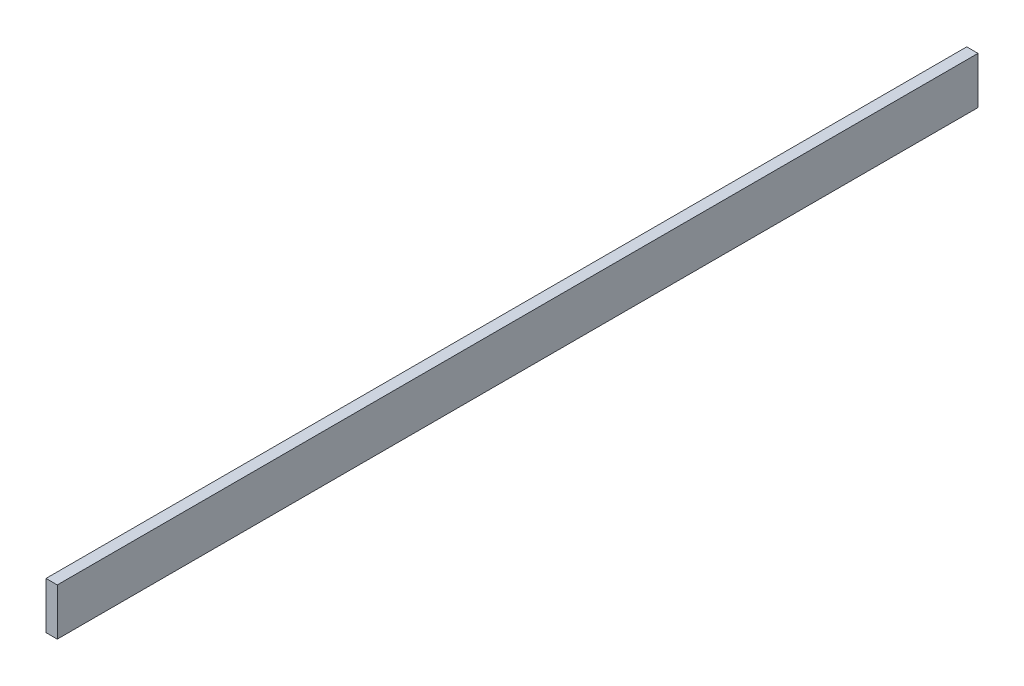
ISO-10303-21;
HEADER;
FILE_DESCRIPTION(('STEP AP214'),'2;1');
FILE_NAME('part.step','',(''),(''),'','','');
FILE_SCHEMA(('AUTOMOTIVE_DESIGN { 1 0 10303 214 1 1 1 1 }'));
ENDSEC;
DATA;
#1=APPLICATION_CONTEXT('core data for automotive mechanical design processes');
#2=APPLICATION_PROTOCOL_DEFINITION('international standard','automotive_design',2000,#1);
#3=PRODUCT_CONTEXT('',#1,'mechanical');
#4=PRODUCT('Part','Part','',(#3));
#5=PRODUCT_RELATED_PRODUCT_CATEGORY('part','',(#4));
#6=PRODUCT_DEFINITION_FORMATION('','',#4);
#7=PRODUCT_DEFINITION_CONTEXT('part definition',#1,'design');
#8=PRODUCT_DEFINITION('design','',#6,#7);
#9=PRODUCT_DEFINITION_SHAPE('','',#8);
#10=(LENGTH_UNIT() NAMED_UNIT(*) SI_UNIT(.MILLI.,.METRE.));
#11=(NAMED_UNIT(*) PLANE_ANGLE_UNIT() SI_UNIT($,.RADIAN.));
#12=(NAMED_UNIT(*) SI_UNIT($,.STERADIAN.) SOLID_ANGLE_UNIT());
#13=UNCERTAINTY_MEASURE_WITH_UNIT(LENGTH_MEASURE(1.E-05),#10,'distance_accuracy_value','');
#14=(GEOMETRIC_REPRESENTATION_CONTEXT(3) GLOBAL_UNCERTAINTY_ASSIGNED_CONTEXT((#13)) GLOBAL_UNIT_ASSIGNED_CONTEXT((#10,
#11,#12)) REPRESENTATION_CONTEXT('',''));
#15=CARTESIAN_POINT('',(0.,0.,0.));
#16=DIRECTION('',(0.,0.,1.));
#17=DIRECTION('',(1.,0.,0.));
#18=AXIS2_PLACEMENT_3D('',#15,#16,#17);
#19=CARTESIAN_POINT('',(0.,0.,490.));
#20=DIRECTION('',(1.,0.,0.));
#21=DIRECTION('',(0.,0.,-1.));
#22=AXIS2_PLACEMENT_3D('',#19,#20,#21);
#23=PLANE('',#22);
#24=DIRECTION('',(0.,-1.,0.));
#25=VECTOR('',#24,1.);
#26=CARTESIAN_POINT('',(0.,0.,0.));
#27=LINE('',#26,#25);
#28=CARTESIAN_POINT('',(0.,25.,0.));
#29=VERTEX_POINT('',#28);
#30=CARTESIAN_POINT('',(0.,0.,0.));
#31=VERTEX_POINT('',#30);
#32=EDGE_CURVE('E70',#29,#31,#27,.T.);
#33=ORIENTED_EDGE('',*,*,#32,.T.);
#34=DIRECTION('',(0.,0.,-1.));
#35=VECTOR('',#34,1.);
#36=CARTESIAN_POINT('',(0.,0.,490.));
#37=LINE('',#36,#35);
#38=CARTESIAN_POINT('',(0.,0.,490.));
#39=VERTEX_POINT('',#38);
#40=EDGE_CURVE('E11',#39,#31,#37,.T.);
#41=ORIENTED_EDGE('',*,*,#40,.F.);
#42=DIRECTION('',(0.,-1.,0.));
#43=VECTOR('',#42,1.);
#44=CARTESIAN_POINT('',(0.,0.,490.));
#45=LINE('',#44,#43);
#46=CARTESIAN_POINT('',(0.,25.,490.));
#47=VERTEX_POINT('',#46);
#48=EDGE_CURVE('E88',#47,#39,#45,.T.);
#49=ORIENTED_EDGE('',*,*,#48,.F.);
#50=DIRECTION('',(0.,0.,-1.));
#51=VECTOR('',#50,1.);
#52=CARTESIAN_POINT('',(0.,25.,490.));
#53=LINE('',#52,#51);
#54=EDGE_CURVE('E82',#47,#29,#53,.T.);
#55=ORIENTED_EDGE('',*,*,#54,.T.);
#56=EDGE_LOOP('',(#33,#41,#49,#55));
#57=FACE_BOUND('',#56,.T.);
#58=ADVANCED_FACE('F26',(#57),#23,.F.);
#59=CARTESIAN_POINT('',(0.,0.,490.));
#60=DIRECTION('',(0.,1.,0.));
#61=DIRECTION('',(0.,0.,1.));
#62=AXIS2_PLACEMENT_3D('',#59,#60,#61);
#63=PLANE('',#62);
#64=DIRECTION('',(1.,0.,0.));
#65=VECTOR('',#64,1.);
#66=CARTESIAN_POINT('',(0.,0.,0.));
#67=LINE('',#66,#65);
#68=CARTESIAN_POINT('',(6.,0.,0.));
#69=VERTEX_POINT('',#68);
#70=EDGE_CURVE('E66',#31,#69,#67,.T.);
#71=ORIENTED_EDGE('',*,*,#70,.T.);
#72=DIRECTION('',(0.,0.,-1.));
#73=VECTOR('',#72,1.);
#74=CARTESIAN_POINT('',(6.,0.,490.));
#75=LINE('',#74,#73);
#76=CARTESIAN_POINT('',(6.,0.,490.));
#77=VERTEX_POINT('',#76);
#78=EDGE_CURVE('E33',#77,#69,#75,.T.);
#79=ORIENTED_EDGE('',*,*,#78,.F.);
#80=DIRECTION('',(1.,0.,0.));
#81=VECTOR('',#80,1.);
#82=CARTESIAN_POINT('',(0.,0.,490.));
#83=LINE('',#82,#81);
#84=EDGE_CURVE('E78',#39,#77,#83,.T.);
#85=ORIENTED_EDGE('',*,*,#84,.F.);
#86=ORIENTED_EDGE('',*,*,#40,.T.);
#87=EDGE_LOOP('',(#71,#79,#85,#86));
#88=FACE_BOUND('',#87,.T.);
#89=ADVANCED_FACE('F77',(#88),#63,.F.);
#90=CARTESIAN_POINT('',(6.,0.,490.));
#91=DIRECTION('',(-1.,0.,0.));
#92=DIRECTION('',(0.,0.,1.));
#93=AXIS2_PLACEMENT_3D('',#90,#91,#92);
#94=PLANE('',#93);
#95=DIRECTION('',(0.,1.,0.));
#96=VECTOR('',#95,1.);
#97=CARTESIAN_POINT('',(6.,0.,0.));
#98=LINE('',#97,#96);
#99=CARTESIAN_POINT('',(6.,25.,0.));
#100=VERTEX_POINT('',#99);
#101=EDGE_CURVE('E71',#69,#100,#98,.T.);
#102=ORIENTED_EDGE('',*,*,#101,.T.);
#103=DIRECTION('',(0.,0.,-1.));
#104=VECTOR('',#103,1.);
#105=CARTESIAN_POINT('',(6.,25.,490.));
#106=LINE('',#105,#104);
#107=CARTESIAN_POINT('',(6.,25.,490.));
#108=VERTEX_POINT('',#107);
#109=EDGE_CURVE('E94',#108,#100,#106,.T.);
#110=ORIENTED_EDGE('',*,*,#109,.F.);
#111=DIRECTION('',(0.,1.,0.));
#112=VECTOR('',#111,1.);
#113=CARTESIAN_POINT('',(6.,0.,490.));
#114=LINE('',#113,#112);
#115=EDGE_CURVE('E45',#77,#108,#114,.T.);
#116=ORIENTED_EDGE('',*,*,#115,.F.);
#117=ORIENTED_EDGE('',*,*,#78,.T.);
#118=EDGE_LOOP('',(#102,#110,#116,#117));
#119=FACE_BOUND('',#118,.T.);
#120=ADVANCED_FACE('F97',(#119),#94,.F.);
#121=CARTESIAN_POINT('',(0.,25.,490.));
#122=DIRECTION('',(0.,-1.,0.));
#123=DIRECTION('',(0.,0.,-1.));
#124=AXIS2_PLACEMENT_3D('',#121,#122,#123);
#125=PLANE('',#124);
#126=DIRECTION('',(-1.,0.,0.));
#127=VECTOR('',#126,1.);
#128=CARTESIAN_POINT('',(0.,25.,0.));
#129=LINE('',#128,#127);
#130=EDGE_CURVE('E86',#100,#29,#129,.T.);
#131=ORIENTED_EDGE('',*,*,#130,.T.);
#132=ORIENTED_EDGE('',*,*,#54,.F.);
#133=DIRECTION('',(-1.,0.,0.));
#134=VECTOR('',#133,1.);
#135=CARTESIAN_POINT('',(0.,25.,490.));
#136=LINE('',#135,#134);
#137=EDGE_CURVE('E40',#108,#47,#136,.T.);
#138=ORIENTED_EDGE('',*,*,#137,.F.);
#139=ORIENTED_EDGE('',*,*,#109,.T.);
#140=EDGE_LOOP('',(#131,#132,#138,#139));
#141=FACE_BOUND('',#140,.T.);
#142=ADVANCED_FACE('F99',(#141),#125,.F.);
#143=CARTESIAN_POINT('',(0.,25.,490.));
#144=DIRECTION('',(0.,0.,-1.));
#145=DIRECTION('',(-1.,0.,0.));
#146=AXIS2_PLACEMENT_3D('',#143,#144,#145);
#147=PLANE('',#146);
#148=ORIENTED_EDGE('',*,*,#48,.T.);
#149=ORIENTED_EDGE('',*,*,#84,.T.);
#150=ORIENTED_EDGE('',*,*,#115,.T.);
#151=ORIENTED_EDGE('',*,*,#137,.T.);
#152=EDGE_LOOP('',(#148,#149,#150,#151));
#153=FACE_BOUND('',#152,.T.);
#154=ADVANCED_FACE('F100',(#153),#147,.F.);
#155=CARTESIAN_POINT('',(0.,25.,0.));
#156=DIRECTION('',(0.,0.,-1.));
#157=DIRECTION('',(-1.,0.,0.));
#158=AXIS2_PLACEMENT_3D('',#155,#156,#157);
#159=PLANE('',#158);
#160=ORIENTED_EDGE('',*,*,#32,.F.);
#161=ORIENTED_EDGE('',*,*,#130,.F.);
#162=ORIENTED_EDGE('',*,*,#101,.F.);
#163=ORIENTED_EDGE('',*,*,#70,.F.);
#164=EDGE_LOOP('',(#160,#161,#162,#163));
#165=FACE_BOUND('',#164,.T.);
#166=ADVANCED_FACE('F67',(#165),#159,.T.);
#167=CLOSED_SHELL('',(#58,#89,#120,#142,#154,#166));
#168=MANIFOLD_SOLID_BREP('B2',#167);
#169=ADVANCED_BREP_SHAPE_REPRESENTATION('',(#18,#168),#14);
#170=SHAPE_DEFINITION_REPRESENTATION(#9,#169);
ENDSEC;
END-ISO-10303-21;
